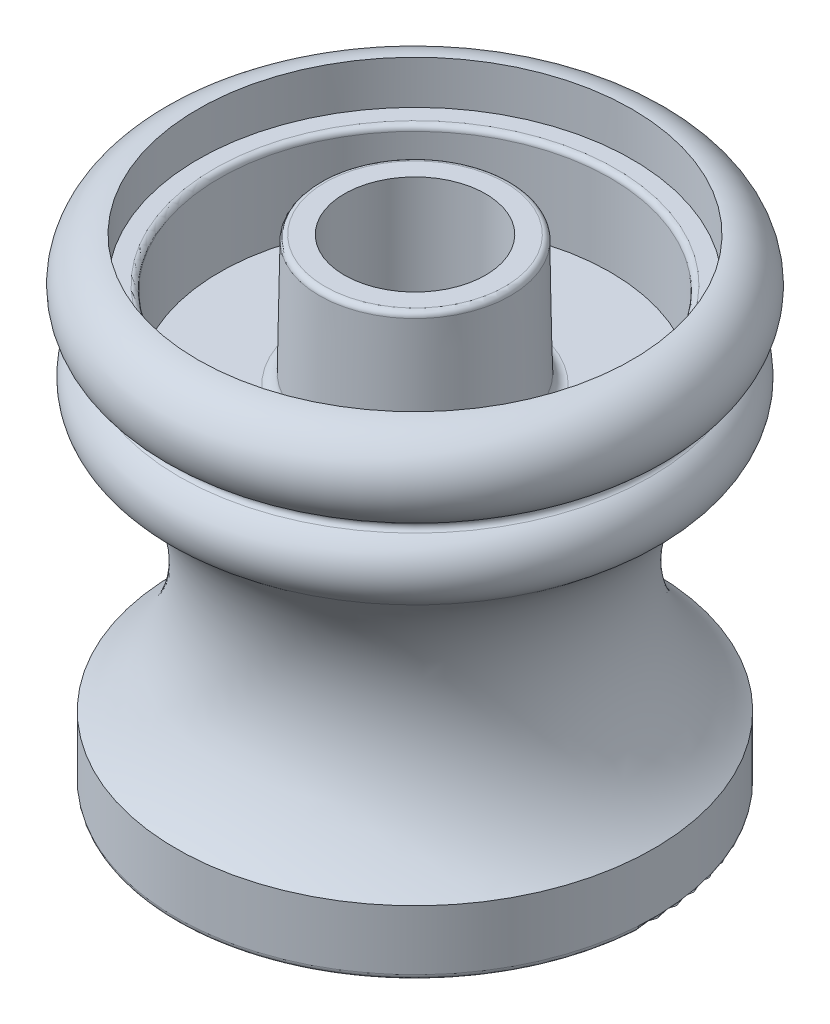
ISO-10303-21;
HEADER;
FILE_DESCRIPTION(('STEP AP214'),'2;1');
FILE_NAME('part.step','',(''),(''),'','','');
FILE_SCHEMA(('AUTOMOTIVE_DESIGN { 1 0 10303 214 1 1 1 1 }'));
ENDSEC;
DATA;
#1=APPLICATION_CONTEXT('core data for automotive mechanical design processes');
#2=APPLICATION_PROTOCOL_DEFINITION('international standard','automotive_design',2000,#1);
#3=PRODUCT_CONTEXT('',#1,'mechanical');
#4=PRODUCT('Part','Part','',(#3));
#5=PRODUCT_RELATED_PRODUCT_CATEGORY('part','',(#4));
#6=PRODUCT_DEFINITION_FORMATION('','',#4);
#7=PRODUCT_DEFINITION_CONTEXT('part definition',#1,'design');
#8=PRODUCT_DEFINITION('design','',#6,#7);
#9=PRODUCT_DEFINITION_SHAPE('','',#8);
#10=(LENGTH_UNIT() NAMED_UNIT(*) SI_UNIT(.MILLI.,.METRE.));
#11=(NAMED_UNIT(*) PLANE_ANGLE_UNIT() SI_UNIT($,.RADIAN.));
#12=(NAMED_UNIT(*) SI_UNIT($,.STERADIAN.) SOLID_ANGLE_UNIT());
#13=UNCERTAINTY_MEASURE_WITH_UNIT(LENGTH_MEASURE(1.E-05),#10,'distance_accuracy_value','');
#14=(GEOMETRIC_REPRESENTATION_CONTEXT(3) GLOBAL_UNCERTAINTY_ASSIGNED_CONTEXT((#13)) GLOBAL_UNIT_ASSIGNED_CONTEXT((#10,
#11,#12)) REPRESENTATION_CONTEXT('',''));
#15=CARTESIAN_POINT('',(0.,0.,0.));
#16=DIRECTION('',(0.,0.,1.));
#17=DIRECTION('',(1.,0.,0.));
#18=AXIS2_PLACEMENT_3D('',#15,#16,#17);
#19=CARTESIAN_POINT('',(0.,16.,0.));
#20=DIRECTION('',(0.,1.,0.));
#21=DIRECTION('',(0.,0.,1.));
#22=AXIS2_PLACEMENT_3D('',#19,#20,#21);
#23=PLANE('',#22);
#24=CARTESIAN_POINT('',(0.,16.,0.));
#25=DIRECTION('',(0.,1.,0.));
#26=DIRECTION('',(0.,0.,1.));
#27=AXIS2_PLACEMENT_3D('',#24,#25,#26);
#28=CIRCLE('',#27,4.99134863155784);
#29=CARTESIAN_POINT('',(0.,16.,4.99134863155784));
#30=VERTEX_POINT('',#29);
#31=EDGE_CURVE('E10',#30,#30,#28,.F.);
#32=ORIENTED_EDGE('',*,*,#31,.T.);
#33=EDGE_LOOP('',(#32));
#34=FACE_BOUND('',#33,.T.);
#35=CARTESIAN_POINT('',(0.,16.,0.));
#36=DIRECTION('',(0.,1.,0.));
#37=DIRECTION('',(0.,0.,1.));
#38=AXIS2_PLACEMENT_3D('',#35,#36,#37);
#39=CIRCLE('',#38,9.);
#40=CARTESIAN_POINT('',(0.,16.,9.));
#41=VERTEX_POINT('',#40);
#42=EDGE_CURVE('E89',#41,#41,#39,.T.);
#43=ORIENTED_EDGE('',*,*,#42,.T.);
#44=EDGE_LOOP('',(#43));
#45=FACE_BOUND('',#44,.T.);
#46=ADVANCED_FACE('F30',(#34,#45),#23,.T.);
#47=CARTESIAN_POINT('',(0.,0.,0.));
#48=DIRECTION('',(0.,-1.,0.));
#49=DIRECTION('',(0.,0.,-1.));
#50=AXIS2_PLACEMENT_3D('',#47,#48,#49);
#51=PLANE('',#50);
#52=CARTESIAN_POINT('',(0.,0.,0.));
#53=DIRECTION('',(0.,-1.,0.));
#54=DIRECTION('',(0.,0.,-1.));
#55=AXIS2_PLACEMENT_3D('',#52,#53,#54);
#56=CIRCLE('',#55,10.75);
#57=CARTESIAN_POINT('',(0.,0.,-10.75));
#58=VERTEX_POINT('',#57);
#59=EDGE_CURVE('E45',#58,#58,#56,.T.);
#60=ORIENTED_EDGE('',*,*,#59,.T.);
#61=EDGE_LOOP('',(#60));
#62=FACE_BOUND('',#61,.T.);
#63=CARTESIAN_POINT('',(0.,0.,0.));
#64=DIRECTION('',(0.,-1.,0.));
#65=DIRECTION('',(0.,0.,-1.));
#66=AXIS2_PLACEMENT_3D('',#63,#64,#65);
#67=CIRCLE('',#66,6.);
#68=CARTESIAN_POINT('',(0.,0.,-6.));
#69=VERTEX_POINT('',#68);
#70=EDGE_CURVE('E80',#69,#69,#67,.T.);
#71=ORIENTED_EDGE('',*,*,#70,.F.);
#72=EDGE_LOOP('',(#71));
#73=FACE_BOUND('',#72,.T.);
#74=ADVANCED_FACE('F116',(#62,#73),#51,.T.);
#75=CARTESIAN_POINT('',(0.,20.,0.));
#76=DIRECTION('',(0.,-1.,0.));
#77=DIRECTION('',(0.,0.,-1.));
#78=AXIS2_PLACEMENT_3D('',#75,#76,#77);
#79=TOROIDAL_SURFACE('',#78,10.,2.);
#80=CARTESIAN_POINT('',(0.,22.,0.));
#81=DIRECTION('',(0.,1.,0.));
#82=DIRECTION('',(0.,0.,1.));
#83=AXIS2_PLACEMENT_3D('',#80,#81,#82);
#84=CIRCLE('',#83,10.);
#85=CARTESIAN_POINT('',(0.,22.,10.));
#86=VERTEX_POINT('',#85);
#87=EDGE_CURVE('E86',#86,#86,#84,.T.);
#88=ORIENTED_EDGE('',*,*,#87,.F.);
#89=EDGE_LOOP('',(#88));
#90=FACE_BOUND('',#89,.T.);
#91=CARTESIAN_POINT('',(0.,18.2020202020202,0.));
#92=DIRECTION('',(0.,-1.,0.));
#93=DIRECTION('',(0.,0.,-1.));
#94=AXIS2_PLACEMENT_3D('',#91,#92,#93);
#95=CIRCLE('',#94,10.8759387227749);
#96=CARTESIAN_POINT('',(0.,18.2020202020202,-10.8759387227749));
#97=VERTEX_POINT('',#96);
#98=EDGE_CURVE('E62',#97,#97,#95,.T.);
#99=ORIENTED_EDGE('',*,*,#98,.F.);
#100=EDGE_LOOP('',(#99));
#101=FACE_BOUND('',#100,.T.);
#102=ADVANCED_FACE('F32',(#90,#101),#79,.T.);
#103=CARTESIAN_POINT('',(0.,17.9772727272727,0.));
#104=DIRECTION('',(0.,-1.,0.));
#105=DIRECTION('',(0.,0.,-1.));
#106=AXIS2_PLACEMENT_3D('',#103,#104,#105);
#107=TOROIDAL_SURFACE('',#106,10.9854310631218,0.25);
#108=ORIENTED_EDGE('',*,*,#98,.T.);
#109=EDGE_LOOP('',(#108));
#110=FACE_BOUND('',#109,.T.);
#111=CARTESIAN_POINT('',(0.,17.7628458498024,0.));
#112=DIRECTION('',(0.,-1.,0.));
#113=DIRECTION('',(0.,0.,-1.));
#114=AXIS2_PLACEMENT_3D('',#111,#112,#113);
#115=CIRCLE('',#114,10.8568965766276);
#116=CARTESIAN_POINT('',(0.,17.7628458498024,-10.8568965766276));
#117=VERTEX_POINT('',#116);
#118=EDGE_CURVE('E65',#117,#117,#115,.T.);
#119=ORIENTED_EDGE('',*,*,#118,.F.);
#120=EDGE_LOOP('',(#119));
#121=FACE_BOUND('',#120,.T.);
#122=ADVANCED_FACE('F158',(#110,#121),#107,.F.);
#123=CARTESIAN_POINT('',(0.,16.3333333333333,0.));
#124=DIRECTION('',(0.,-1.,0.));
#125=DIRECTION('',(0.,0.,-1.));
#126=AXIS2_PLACEMENT_3D('',#123,#124,#125);
#127=TOROIDAL_SURFACE('',#126,10.,1.66666666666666);
#128=ORIENTED_EDGE('',*,*,#118,.T.);
#129=EDGE_LOOP('',(#128));
#130=FACE_BOUND('',#129,.T.);
#131=CARTESIAN_POINT('',(0.,15.,0.));
#132=DIRECTION('',(0.,-1.,0.));
#133=DIRECTION('',(0.,0.,-1.));
#134=AXIS2_PLACEMENT_3D('',#131,#132,#133);
#135=CIRCLE('',#134,11.);
#136=CARTESIAN_POINT('',(0.,15.,-11.));
#137=VERTEX_POINT('',#136);
#138=EDGE_CURVE('E68',#137,#137,#135,.T.);
#139=ORIENTED_EDGE('',*,*,#138,.F.);
#140=EDGE_LOOP('',(#139));
#141=FACE_BOUND('',#140,.T.);
#142=ADVANCED_FACE('F155',(#130,#141),#127,.T.);
#143=CARTESIAN_POINT('',(0.,9.,0.));
#144=DIRECTION('',(0.,-1.,0.));
#145=DIRECTION('',(0.,0.,-1.));
#146=AXIS2_PLACEMENT_3D('',#143,#144,#145);
#147=TOROIDAL_SURFACE('',#146,15.5,7.5);
#148=ORIENTED_EDGE('',*,*,#138,.T.);
#149=EDGE_LOOP('',(#148));
#150=FACE_BOUND('',#149,.T.);
#151=CARTESIAN_POINT('',(0.,3.,0.));
#152=DIRECTION('',(0.,-1.,0.));
#153=DIRECTION('',(0.,0.,-1.));
#154=AXIS2_PLACEMENT_3D('',#151,#152,#153);
#155=CIRCLE('',#154,11.);
#156=CARTESIAN_POINT('',(0.,3.,-11.));
#157=VERTEX_POINT('',#156);
#158=EDGE_CURVE('E71',#157,#157,#155,.T.);
#159=ORIENTED_EDGE('',*,*,#158,.F.);
#160=EDGE_LOOP('',(#159));
#161=FACE_BOUND('',#160,.T.);
#162=ADVANCED_FACE('F151',(#150,#161),#147,.F.);
#163=CARTESIAN_POINT('',(0.,0.,0.));
#164=DIRECTION('',(0.,-1.,0.));
#165=DIRECTION('',(0.,0.,-1.));
#166=AXIS2_PLACEMENT_3D('',#163,#164,#165);
#167=CYLINDRICAL_SURFACE('',#166,11.);
#168=CARTESIAN_POINT('',(0.,0.25,0.));
#169=DIRECTION('',(0.,-1.,0.));
#170=DIRECTION('',(0.,0.,-1.));
#171=AXIS2_PLACEMENT_3D('',#168,#169,#170);
#172=CIRCLE('',#171,11.);
#173=CARTESIAN_POINT('',(0.,0.25,-11.));
#174=VERTEX_POINT('',#173);
#175=EDGE_CURVE('E41',#174,#174,#172,.F.);
#176=ORIENTED_EDGE('',*,*,#175,.T.);
#177=EDGE_LOOP('',(#176));
#178=FACE_BOUND('',#177,.T.);
#179=ORIENTED_EDGE('',*,*,#158,.T.);
#180=EDGE_LOOP('',(#179));
#181=FACE_BOUND('',#180,.T.);
#182=ADVANCED_FACE('F146',(#178,#181),#167,.T.);
#183=CARTESIAN_POINT('',(0.,12.,0.));
#184=DIRECTION('',(0.,-1.,0.));
#185=DIRECTION('',(0.,0.,-1.));
#186=AXIS2_PLACEMENT_3D('',#183,#184,#185);
#187=PLANE('',#186);
#188=CARTESIAN_POINT('',(0.,12.,0.));
#189=DIRECTION('',(0.,-1.,0.));
#190=DIRECTION('',(0.,0.,-1.));
#191=AXIS2_PLACEMENT_3D('',#188,#189,#190);
#192=CIRCLE('',#191,3.25);
#193=CARTESIAN_POINT('',(0.,12.,-3.25));
#194=VERTEX_POINT('',#193);
#195=EDGE_CURVE('E92',#194,#194,#192,.T.);
#196=ORIENTED_EDGE('',*,*,#195,.F.);
#197=EDGE_LOOP('',(#196));
#198=FACE_BOUND('',#197,.T.);
#199=CARTESIAN_POINT('',(0.,12.,0.));
#200=DIRECTION('',(0.,-1.,0.));
#201=DIRECTION('',(0.,0.,-1.));
#202=AXIS2_PLACEMENT_3D('',#199,#200,#201);
#203=CIRCLE('',#202,4.5);
#204=CARTESIAN_POINT('',(0.,12.,-4.5));
#205=VERTEX_POINT('',#204);
#206=EDGE_CURVE('E74',#205,#205,#203,.T.);
#207=ORIENTED_EDGE('',*,*,#206,.T.);
#208=EDGE_LOOP('',(#207));
#209=FACE_BOUND('',#208,.T.);
#210=ADVANCED_FACE('F143',(#198,#209),#187,.T.);
#211=CARTESIAN_POINT('',(0.,0.,0.));
#212=DIRECTION('',(0.,-1.,0.));
#213=DIRECTION('',(0.,0.,-1.));
#214=AXIS2_PLACEMENT_3D('',#211,#212,#213);
#215=CYLINDRICAL_SURFACE('',#214,4.5);
#216=CARTESIAN_POINT('',(0.,0.545955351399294,0.));
#217=DIRECTION('',(0.,-1.,0.));
#218=DIRECTION('',(0.,0.,-1.));
#219=AXIS2_PLACEMENT_3D('',#216,#217,#218);
#220=CIRCLE('',#219,4.5);
#221=CARTESIAN_POINT('',(0.,0.545955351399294,-4.5));
#222=VERTEX_POINT('',#221);
#223=EDGE_CURVE('E77',#222,#222,#220,.T.);
#224=ORIENTED_EDGE('',*,*,#223,.T.);
#225=EDGE_LOOP('',(#224));
#226=FACE_BOUND('',#225,.T.);
#227=ORIENTED_EDGE('',*,*,#206,.F.);
#228=EDGE_LOOP('',(#227));
#229=FACE_BOUND('',#228,.T.);
#230=ADVANCED_FACE('F139',(#226,#229),#215,.F.);
#231=CARTESIAN_POINT('',(0.,0.545955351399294,0.));
#232=DIRECTION('',(0.,-1.,0.));
#233=DIRECTION('',(0.,0.,-1.));
#234=AXIS2_PLACEMENT_3D('',#231,#232,#233);
#235=CONICAL_SURFACE('',#234,4.5,1.22173047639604);
#236=ORIENTED_EDGE('',*,*,#70,.T.);
#237=EDGE_LOOP('',(#236));
#238=FACE_BOUND('',#237,.T.);
#239=ORIENTED_EDGE('',*,*,#223,.F.);
#240=EDGE_LOOP('',(#239));
#241=FACE_BOUND('',#240,.T.);
#242=ADVANCED_FACE('F135',(#238,#241),#235,.F.);
#243=CARTESIAN_POINT('',(0.,20.,0.));
#244=DIRECTION('',(0.,1.,0.));
#245=DIRECTION('',(0.,0.,1.));
#246=AXIS2_PLACEMENT_3D('',#243,#244,#245);
#247=CYLINDRICAL_SURFACE('',#246,10.);
#248=CARTESIAN_POINT('',(0.,20.,0.));
#249=DIRECTION('',(0.,1.,0.));
#250=DIRECTION('',(0.,0.,1.));
#251=AXIS2_PLACEMENT_3D('',#248,#249,#250);
#252=CIRCLE('',#251,10.);
#253=CARTESIAN_POINT('',(0.,20.,10.));
#254=VERTEX_POINT('',#253);
#255=EDGE_CURVE('E83',#254,#254,#252,.T.);
#256=ORIENTED_EDGE('',*,*,#255,.F.);
#257=EDGE_LOOP('',(#256));
#258=FACE_BOUND('',#257,.T.);
#259=ORIENTED_EDGE('',*,*,#87,.T.);
#260=EDGE_LOOP('',(#259));
#261=FACE_BOUND('',#260,.T.);
#262=ADVANCED_FACE('F131',(#258,#261),#247,.F.);
#263=CARTESIAN_POINT('',(0.,20.,0.));
#264=DIRECTION('',(0.,1.,0.));
#265=DIRECTION('',(0.,0.,1.));
#266=AXIS2_PLACEMENT_3D('',#263,#264,#265);
#267=PLANE('',#266);
#268=CARTESIAN_POINT('',(0.,20.,0.));
#269=DIRECTION('',(0.,1.,0.));
#270=DIRECTION('',(0.,0.,1.));
#271=AXIS2_PLACEMENT_3D('',#268,#269,#270);
#272=CIRCLE('',#271,9.25);
#273=CARTESIAN_POINT('',(0.,20.,9.25));
#274=VERTEX_POINT('',#273);
#275=EDGE_CURVE('E56',#274,#274,#272,.F.);
#276=ORIENTED_EDGE('',*,*,#275,.T.);
#277=EDGE_LOOP('',(#276));
#278=FACE_BOUND('',#277,.T.);
#279=ORIENTED_EDGE('',*,*,#255,.T.);
#280=EDGE_LOOP('',(#279));
#281=FACE_BOUND('',#280,.T.);
#282=ADVANCED_FACE('F127',(#278,#281),#267,.T.);
#283=CARTESIAN_POINT('',(0.,16.,0.));
#284=DIRECTION('',(0.,1.,0.));
#285=DIRECTION('',(0.,0.,1.));
#286=AXIS2_PLACEMENT_3D('',#283,#284,#285);
#287=CYLINDRICAL_SURFACE('',#286,9.);
#288=CARTESIAN_POINT('',(0.,19.75,0.));
#289=DIRECTION('',(0.,1.,0.));
#290=DIRECTION('',(0.,0.,1.));
#291=AXIS2_PLACEMENT_3D('',#288,#289,#290);
#292=CIRCLE('',#291,9.);
#293=CARTESIAN_POINT('',(0.,19.75,9.));
#294=VERTEX_POINT('',#293);
#295=EDGE_CURVE('E59',#294,#294,#292,.T.);
#296=ORIENTED_EDGE('',*,*,#295,.T.);
#297=EDGE_LOOP('',(#296));
#298=FACE_BOUND('',#297,.T.);
#299=ORIENTED_EDGE('',*,*,#42,.F.);
#300=EDGE_LOOP('',(#299));
#301=FACE_BOUND('',#300,.T.);
#302=ADVANCED_FACE('F113',(#298,#301),#287,.F.);
#303=CARTESIAN_POINT('',(0.,16.,0.));
#304=DIRECTION('',(0.,-1.,0.));
#305=DIRECTION('',(0.,0.,1.));
#306=AXIS2_PLACEMENT_3D('',#303,#304,#305);
#307=CONICAL_SURFACE('',#306,4.5,0.0174532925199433);
#308=CARTESIAN_POINT('',(0.,16.4912737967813,0.));
#309=DIRECTION('',(0.,1.,0.));
#310=DIRECTION('',(0.,0.,1.));
#311=AXIS2_PLACEMENT_3D('',#308,#309,#310);
#312=CIRCLE('',#311,4.49142478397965);
#313=CARTESIAN_POINT('',(0.,16.4912737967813,4.49142478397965));
#314=VERTEX_POINT('',#313);
#315=EDGE_CURVE('E37',#314,#314,#312,.T.);
#316=ORIENTED_EDGE('',*,*,#315,.T.);
#317=EDGE_LOOP('',(#316));
#318=FACE_BOUND('',#317,.T.);
#319=CARTESIAN_POINT('',(0.,21.7543631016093,0.));
#320=DIRECTION('',(0.,-1.,0.));
#321=DIRECTION('',(0.,0.,-1.));
#322=AXIS2_PLACEMENT_3D('',#319,#320,#321);
#323=CIRCLE('',#322,4.39955721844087);
#324=CARTESIAN_POINT('',(0.,21.7543631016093,-4.39955721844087));
#325=VERTEX_POINT('',#324);
#326=EDGE_CURVE('E50',#325,#325,#323,.T.);
#327=ORIENTED_EDGE('',*,*,#326,.T.);
#328=EDGE_LOOP('',(#327));
#329=FACE_BOUND('',#328,.T.);
#330=ADVANCED_FACE('F103',(#318,#329),#307,.T.);
#331=CARTESIAN_POINT('',(0.,22.,0.));
#332=DIRECTION('',(0.,1.,0.));
#333=DIRECTION('',(0.,0.,1.));
#334=AXIS2_PLACEMENT_3D('',#331,#332,#333);
#335=PLANE('',#334);
#336=CARTESIAN_POINT('',(0.,22.,0.));
#337=DIRECTION('',(0.,1.,0.));
#338=DIRECTION('',(0.,0.,1.));
#339=AXIS2_PLACEMENT_3D('',#336,#337,#338);
#340=CIRCLE('',#339,4.14959529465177);
#341=CARTESIAN_POINT('',(0.,22.,4.14959529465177));
#342=VERTEX_POINT('',#341);
#343=EDGE_CURVE('E53',#342,#342,#340,.T.);
#344=ORIENTED_EDGE('',*,*,#343,.T.);
#345=EDGE_LOOP('',(#344));
#346=FACE_BOUND('',#345,.T.);
#347=CARTESIAN_POINT('',(0.,22.,0.));
#348=DIRECTION('',(0.,1.,0.));
#349=DIRECTION('',(0.,0.,1.));
#350=AXIS2_PLACEMENT_3D('',#347,#348,#349);
#351=CIRCLE('',#350,3.25);
#352=CARTESIAN_POINT('',(0.,22.,3.25));
#353=VERTEX_POINT('',#352);
#354=EDGE_CURVE('E95',#353,#353,#351,.T.);
#355=ORIENTED_EDGE('',*,*,#354,.F.);
#356=EDGE_LOOP('',(#355));
#357=FACE_BOUND('',#356,.T.);
#358=ADVANCED_FACE('F101',(#346,#357),#335,.T.);
#359=CARTESIAN_POINT('',(0.,0.,0.));
#360=DIRECTION('',(0.,1.,0.));
#361=DIRECTION('',(0.,0.,1.));
#362=AXIS2_PLACEMENT_3D('',#359,#360,#361);
#363=CYLINDRICAL_SURFACE('',#362,3.25);
#364=ORIENTED_EDGE('',*,*,#195,.T.);
#365=EDGE_LOOP('',(#364));
#366=FACE_BOUND('',#365,.T.);
#367=ORIENTED_EDGE('',*,*,#354,.T.);
#368=EDGE_LOOP('',(#367));
#369=FACE_BOUND('',#368,.T.);
#370=ADVANCED_FACE('F99',(#366,#369),#363,.F.);
#371=CARTESIAN_POINT('',(0.,19.75,0.));
#372=DIRECTION('',(0.,1.,0.));
#373=DIRECTION('',(0.,0.,1.));
#374=AXIS2_PLACEMENT_3D('',#371,#372,#373);
#375=TOROIDAL_SURFACE('',#374,9.25,0.25);
#376=ORIENTED_EDGE('',*,*,#275,.F.);
#377=EDGE_LOOP('',(#376));
#378=FACE_BOUND('',#377,.T.);
#379=ORIENTED_EDGE('',*,*,#295,.F.);
#380=EDGE_LOOP('',(#379));
#381=FACE_BOUND('',#380,.T.);
#382=ADVANCED_FACE('F110',(#378,#381),#375,.T.);
#383=CARTESIAN_POINT('',(0.,21.75,0.));
#384=DIRECTION('',(0.,1.,0.));
#385=DIRECTION('',(0.,0.,1.));
#386=AXIS2_PLACEMENT_3D('',#383,#384,#385);
#387=TOROIDAL_SURFACE('',#386,4.14959529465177,0.25);
#388=ORIENTED_EDGE('',*,*,#326,.F.);
#389=EDGE_LOOP('',(#388));
#390=FACE_BOUND('',#389,.T.);
#391=ORIENTED_EDGE('',*,*,#343,.F.);
#392=EDGE_LOOP('',(#391));
#393=FACE_BOUND('',#392,.T.);
#394=ADVANCED_FACE('F223',(#390,#393),#387,.T.);
#395=CARTESIAN_POINT('',(0.,0.25,0.));
#396=DIRECTION('',(0.,-1.,0.));
#397=DIRECTION('',(0.,0.,-1.));
#398=AXIS2_PLACEMENT_3D('',#395,#396,#397);
#399=TOROIDAL_SURFACE('',#398,10.75,0.25);
#400=ORIENTED_EDGE('',*,*,#175,.F.);
#401=EDGE_LOOP('',(#400));
#402=FACE_BOUND('',#401,.T.);
#403=ORIENTED_EDGE('',*,*,#59,.F.);
#404=EDGE_LOOP('',(#403));
#405=FACE_BOUND('',#404,.T.);
#406=ADVANCED_FACE('F233',(#402,#405),#399,.T.);
#407=CARTESIAN_POINT('',(0.,16.5,0.));
#408=DIRECTION('',(0.,1.,0.));
#409=DIRECTION('',(0.,0.,1.));
#410=AXIS2_PLACEMENT_3D('',#407,#408,#409);
#411=TOROIDAL_SURFACE('',#410,4.99134863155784,0.5);
#412=ORIENTED_EDGE('',*,*,#31,.F.);
#413=EDGE_LOOP('',(#412));
#414=FACE_BOUND('',#413,.T.);
#415=ORIENTED_EDGE('',*,*,#315,.F.);
#416=EDGE_LOOP('',(#415));
#417=FACE_BOUND('',#416,.T.);
#418=ADVANCED_FACE('F242',(#414,#417),#411,.F.);
#419=CLOSED_SHELL('',(#46,#74,#102,#122,#142,#162,#182,#210,#230,#242,#262,#282,#302,#330,#358,
#370,#382,#394,#406,#418));
#420=MANIFOLD_SOLID_BREP('B2',#419);
#421=ADVANCED_BREP_SHAPE_REPRESENTATION('',(#18,#420),#14);
#422=SHAPE_DEFINITION_REPRESENTATION(#9,#421);
ENDSEC;
END-ISO-10303-21;
